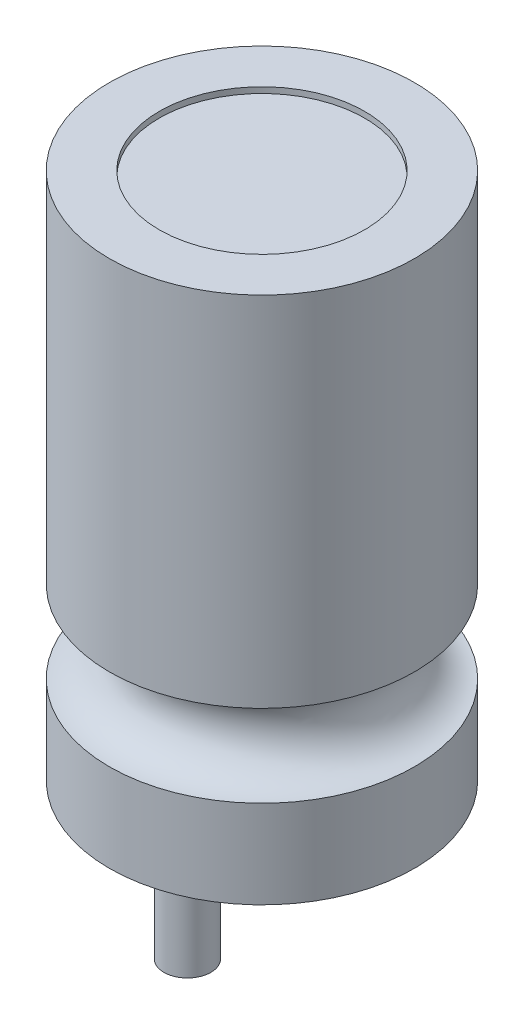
from build123d import *

# Parameters (mm, degrees)
ESQUISSE2_R             = 1.75
ENL_V_MAT_EXTRU_1_DEPTH = 0.1
ESQUISSE3_R             = 0.4
BOSS_EXTRU_1_DEPTH      = 2


with BuildPart() as part:
    # Esquisse1 → R_volution1 (revolve)
    with BuildSketch(Plane.XY, mode=Mode.PRIVATE) as r_volution1_sk:
        with BuildLine():
            Line((0, 36.516423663), (2.6, 36.516423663))
            Line((2.6, 36.516423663), (2.6, 30.416423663))
            ThreePointArc((2.6, 30.416423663), (1.9, 29.716423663), (2.6, 29.016423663))
            Line((2.6, 29.016423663), (2.6, 27.516423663))
            Line((2.6, 27.516423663), (0, 27.516423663))
            Line((0, 27.516423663), (0, 36.516423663))
        make_face()
    revolve(r_volution1_sk.sketch.rotate(Axis((0, 48.401709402, 0), (0, -1, 0)), 90), axis=Axis((0, 48.401709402, 0), (0, -1, 0)))

    # Esquisse2 → Enl_v. mat.-Extru.1 (cut)
    with BuildSketch(Plane(origin=(0, 36.516423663, 0), x_dir=(-1, 0, 0), z_dir=(0, 1, 0))):
        with Locations(Location((0, 0, 0), (0, 0, 90))):
            Circle(ESQUISSE2_R)
    extrude(amount=-ENL_V_MAT_EXTRU_1_DEPTH, mode=Mode.SUBTRACT)

    # Esquisse3 → Boss.-Extru.1 (add)
    with BuildSketch(Plane.XZ.offset(-27.516423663)):
        with Locations(Location((0, 1.27, 0), (0, 0, 90))):
            Circle(ESQUISSE3_R)
        with Locations(Location((0, -1.27, 0), (0, 0, 90))):
            Circle(ESQUISSE3_R)
    extrude(amount=BOSS_EXTRU_1_DEPTH)


solid = part.part
